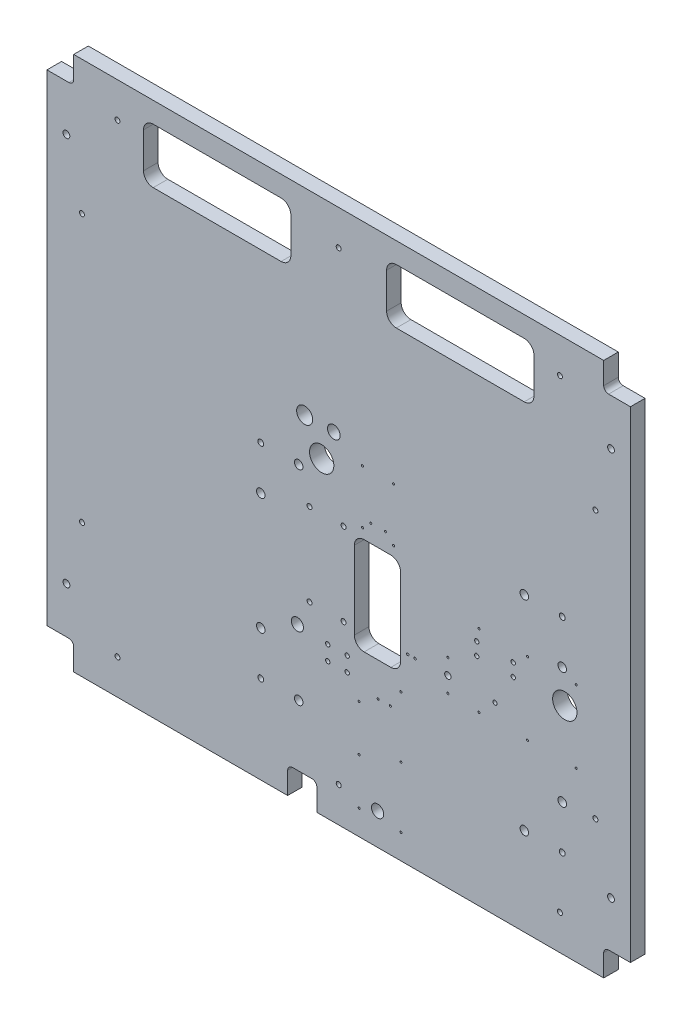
from build123d import *

# Parameters (mm, degrees)
SKIZZE1_W                        = 1200
SKIZZE1_H                        = 1100
AUFSATZ_LINEAR_AUSTRAGEN1_DEPTH  = 30
SKIZZE2_W                        = 95
SKIZZE2_H                        = 200
SCHNITT_LINEAR_AUSTRAGEN1_DEPTH  = 815.493707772
DURCHGANGSLOCH_F_R_M81_D         = 9
LINEARES_MUSTER1_COUNT           = 2
LINEARES_MUSTER1_PITCH           = 75
LINEARES_MUSTER1_COUNT_DIR2      = 2
LINEARES_MUSTER1_PITCH_DIR2      = 26
M10_GEWINDEBOHRUNG1_D            = 8.5
M5_GEWINDEBOHRUNG1_D             = 4.2
M5_GEWINDEBOHRUNG2_D             = 4.2
M5_GEWINDEBOHRUNG3_D             = 4.2
F_13_0_13_DURCHMESSER_BOHRUNG1_D = 13
SKIZZE18_W                       = 55
SKIZZE18_H                       = 55
SKIZZE18_W_2                     = 60
SCHNITT_LINEAR_AUSTRAGEN2_DEPTH  = 815.493707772
M16_GEWINDEBOHRUNG1_D            = 14
M6_GEWINDEBOHRUNG1_D             = 5
SKIZZE25_W                       = 303
SKIZZE25_H                       = 113
SCHNITT_LINEAR_AUSTRAGEN3_DEPTH  = 815.493707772
F_26_0_26_DURCHMESSER_BOHRUNG1_D = 26
SKIZZE30_R                       = 25
SKIZZE30_R_2                     = 12.5
SCHNITT_LINEAR_AUSTRAGEN4_DEPTH  = 815.493707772
F_33_0_33_DURCHMESSER_BOHRUNG1_D = 33
M5_GEWINDEBOHRUNG_DECKBLECHE_D   = 4.2
DURCHGANGSLOCH_F_R_M161_D        = 17.5
F_12_0_12_DURCHMESSER_BOHRUNG1_D = 12
DURCHGANGSLOCH_F_R_M82_D         = 9
VERRUNDUNG1_R                    = 20
VERRUNDUNG2_R                    = 20
M12_GEWINDEBOHRUNG3_D            = 10.2
VERRUNDUNG3_R                    = 10


with BuildPart() as part:
    # Skizze1 → Aufsatz-Linear austragen1 (new body)
    with BuildSketch(Plane.XY):
        Rectangle(SKIZZE1_W, SKIZZE1_H)
    extrude(amount=AUFSATZ_LINEAR_AUSTRAGEN1_DEPTH)

    # Skizze2 → Schnitt-Linear austragen1 (cut, through all)
    with BuildSketch(Plane(origin=(0, 0, 0), x_dir=(-1, 0, 0), z_dir=(0, 0, -1))):
        with Locations((-79.72931174, -115.6)):
            Rectangle(SKIZZE2_W, SKIZZE2_H)
    extrude(amount=-SCHNITT_LINEAR_AUSTRAGEN1_DEPTH, mode=Mode.SUBTRACT)

    # Durchgangsloch f_r M81 (through all)
    with Locations(Plane.XY.offset(30)):
        with Locations((358.95531174, -80.947024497)):
            durchgangsloch_f_r_m81 = Hole(DURCHGANGSLOCH_F_R_M81_D / 2)

    # Lineares Muster1: Durchgangsloch f_r M81 2 × 2
    with Locations(*[(-i * LINEARES_MUSTER1_PITCH, -j * LINEARES_MUSTER1_PITCH_DIR2, 0) for i in range(LINEARES_MUSTER1_COUNT) for j in range(LINEARES_MUSTER1_COUNT_DIR2) if (i, j) != (0, 0)]):
        add(durchgangsloch_f_r_m81, mode=Mode.SUBTRACT)

    # M10 Gewindebohrung1 (through all)
    with Locations(Plane(origin=(0, 0, 0), x_dir=(-1, 0, 0), z_dir=(0, 0, -1))):
        with Locations((-321.45531174, -171.447024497)):
            Hole(M10_GEWINDEBOHRUNG1_D / 2)

    # M5 Gewindebohrung1 (through all)
    with Locations(Plane(origin=(0, 0, 0), x_dir=(-1, 0, 0), z_dir=(0, 0, -1))):
        with Locations((-65.928346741, 20.552975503), (-95.928346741, 20.552975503)):
            Hole(M5_GEWINDEBOHRUNG1_D / 2)

    # M5 Gewindebohrung2 (through all)
    with Locations(Plane.XY.offset(30)):
        with Locations((106.22931174, -284.926950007), (81.22931174, -284.926950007)):
            Hole(M5_GEWINDEBOHRUNG2_D / 2)

    # M5 Gewindebohrung3 (through all)
    with Locations(Plane.XY.offset(30)):
        with Locations((224.45531174, -139.447024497), (224.45531174, -203.447024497)):
            Hole(M5_GEWINDEBOHRUNG3_D / 2)

    # 13.0 _13_ Durchmesser Bohrung1 (through all)
    with Locations(Plane(origin=(0, 0, 0), x_dir=(-1, 0, 0), z_dir=(0, 0, -1))):
        with Locations((-224.45531174, -171.447024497)):
            Hole(F_13_0_13_DURCHMESSER_BOHRUNG1_D / 2)

    # Skizze18 → Schnitt-Linear austragen2 (cut, through all)
    with BuildSketch(Plane(origin=(0, 0, 0), x_dir=(-1, 0, 0), z_dir=(0, 0, -1))):
        with Locations((-572.5, 522.5)):
            Rectangle(SKIZZE18_W, SKIZZE18_H)
        with Locations((572.5, 522.5)):
            Rectangle(SKIZZE18_W, SKIZZE18_H)
        with Locations((572.5, -522.5)):
            Rectangle(SKIZZE18_W, SKIZZE18_H)
        with Locations((-572.5, -522.5)):
            Rectangle(SKIZZE18_W, SKIZZE18_H)
        with Locations((75, -522.5)):
            Rectangle(SKIZZE18_W_2, SKIZZE18_H)
    extrude(amount=-SCHNITT_LINEAR_AUSTRAGEN2_DEPTH, mode=Mode.SUBTRACT)

    # M16 Gewindebohrung1 (through all)
    with Locations(Plane(origin=(0, 0, 0), x_dir=(-1, 0, 0), z_dir=(0, 0, -1))):
        with Locations((-560, -400), (-560, 400), (560, 400), (560, -400)):
            Hole(M16_GEWINDEBOHRUNG1_D / 2)

    # M6 Gewindebohrung1 (through all)
    with Locations(Plane(origin=(0, 0, 0), x_dir=(-1, 0, 0), z_dir=(0, 0, -1))):
        with Locations((-157, -175), (-142, -175)):
            Hole(M6_GEWINDEBOHRUNG1_D / 2)

    # Skizze25 → Schnitt-Linear austragen3 (cut, through all)
    with BuildSketch(Plane.XY.offset(30)):
        with Locations((-250, 451)):
            Rectangle(SKIZZE25_W, SKIZZE25_H)
        with Locations((250, 451)):
            Rectangle(SKIZZE25_W, SKIZZE25_H)
    extrude(amount=-SCHNITT_LINEAR_AUSTRAGEN3_DEPTH, mode=Mode.SUBTRACT)

    # 26.0 _26_ Durchmesser Bohrung1 (through all)
    with Locations(Plane(origin=(0, 0, 0), x_dir=(-1, 0, 0), z_dir=(0, 0, -1))):
        with Locations((10, 145)):
            Hole(F_26_0_26_DURCHMESSER_BOHRUNG1_D / 2)

    # Skizze30 → Schnitt-Linear austragen4 (cut, through all)
    with BuildSketch(Plane(origin=(0, 0, 0), x_dir=(-1, 0, 0), z_dir=(0, 0, -1))):
        with Locations((-465, -105)):
            Circle(SKIZZE30_R)
        with Locations((35, 85)):
            Circle(SKIZZE30_R)
        with Locations((85, -235)):
            Circle(SKIZZE30_R_2)
        with Locations((-80, -485)):
            Circle(SKIZZE30_R_2)
    extrude(amount=-SCHNITT_LINEAR_AUSTRAGEN4_DEPTH, mode=Mode.SUBTRACT)

    # 33.0 _33_ Durchmesser Bohrung1 (through all)
    with Locations(Plane(origin=(0, 0, 0), x_dir=(-1, 0, 0), z_dir=(0, 0, -1))):
        with Locations((70, 145)):
            Hole(F_33_0_33_DURCHMESSER_BOHRUNG1_D / 2)

    # M5 Gewindebohrung Deckbleche (through all)
    with Locations(Plane.XY.offset(30)):
        with Locations((288.45531174, -204.947024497), (42.02931174, -498.851484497), (42.02931174, -403.851484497), (128.02931174, -498.851484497), (128.02931174, -373.851484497), (128.02931174, -248.851484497), (488.45531174, -55.947024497), (388.45531174, -55.947024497), (288.45531174, -55.947024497), (488.45531174, -204.947024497), (388.45531174, -204.947024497), (48.928346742, 114.052975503), (48.928346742, 4.052975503), (112.928346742, 4.052975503), (112.928346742, 114.052975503), (42.02931174, -308.851484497)):
            Hole(M5_GEWINDEBOHRUNG_DECKBLECHE_D / 2)

    # Durchgangsloch f_r M161 (through all)
    with Locations(Plane(origin=(0, 0, 0), x_dir=(-1, 0, 0), z_dir=(0, 0, -1))):
        with Locations((-381.72931174, -369.1), (-459.72931174, -39.1), (-381.72931174, 50.9), (-459.72931174, -279.1), (82.27068826, 50.9), (160.27068826, -39.1), (160.27068826, -279.1), (82.27068826, -369.1)):
            Hole(DURCHGANGSLOCH_F_R_M161_D / 2)

    # 12.0 _12_ Durchmesser Bohrung1 (through all)
    with Locations(Plane(origin=(0, 0, 0), x_dir=(-1, 0, 0), z_dir=(0, 0, -1))):
        with Locations((-459.72931174, 50.9), (-459.72931174, -369.1), (160.27068826, -369.1), (160.27068826, 50.9)):
            Hole(F_12_0_12_DURCHMESSER_BOHRUNG1_D / 2)

    # Durchgangsloch f_r M82 (through all)
    with Locations(Plane.XY.offset(30)):
        with Locations((-22.54468826, -269.447024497), (17.45531174, -269.447024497), (17.45531174, -239.447024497), (-22.54468826, -239.447024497)):
            Hole(DURCHGANGSLOCH_F_R_M82_D / 2)

    # Verrundung1
    verrundung1_edges = [part.edges().sort_by_distance(p)[0] for p in [
        (-98.5, 394.5, 15),
        (-401.5, 394.5, 15),
        (-401.5, 507.5, 15),
        (-98.5, 507.5, 15),
        (98.5, 394.5, 15),
        (98.5, 507.5, 15),
        (401.5, 507.5, 15),
        (401.5, 394.5, 15),
    ]]
    fillet(verrundung1_edges, radius=VERRUNDUNG1_R)

    # Verrundung2
    verrundung2_edges = [part.edges().sort_by_distance(p)[0] for p in [
        (32.22931174, -15.6, 15),
        (32.22931174, -215.6, 15),
        (127.22931174, -215.6, 15),
        (127.22931174, -15.6, 15),
    ]]
    fillet(verrundung2_edges, radius=VERRUNDUNG2_R)

    # M12 Gewindebohrung3 (through all)
    with Locations(Plane(origin=(320.30742788, -292.131169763, 0), x_dir=(1, 0, 0), z_dir=(0, 0, -1))):
        with Locations((134.69257212, -770.131169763), (-320.30742788, -770.131169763), (-775.30742788, -770.131169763), (-848.30742788, -567.131169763), (-848.30742788, -17.131169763), (-775.30742788, 185.868830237), (134.69257212, 185.868830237), (-320.30742788, 185.868830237), (207.69257212, -567.131169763), (207.69257212, -17.131169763), (-310.30742788, -109.409934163), (-380.30742788, -109.409934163), (-310.30742788, -279.409934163), (-380.30742788, -279.409934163)):
            Hole(M12_GEWINDEBOHRUNG3_D / 2)

    # Verrundung3
    verrundung3_edges = [part.edges().sort_by_distance(p)[0] for p in [
        (-545, -495, 15),
        (545, -495, 15),
        (-45, -495, 15),
        (-105, -495, 15),
        (545, 495, 15),
        (-545, 495, 15),
    ]]
    fillet(verrundung3_edges, radius=VERRUNDUNG3_R)


solid = part.part
